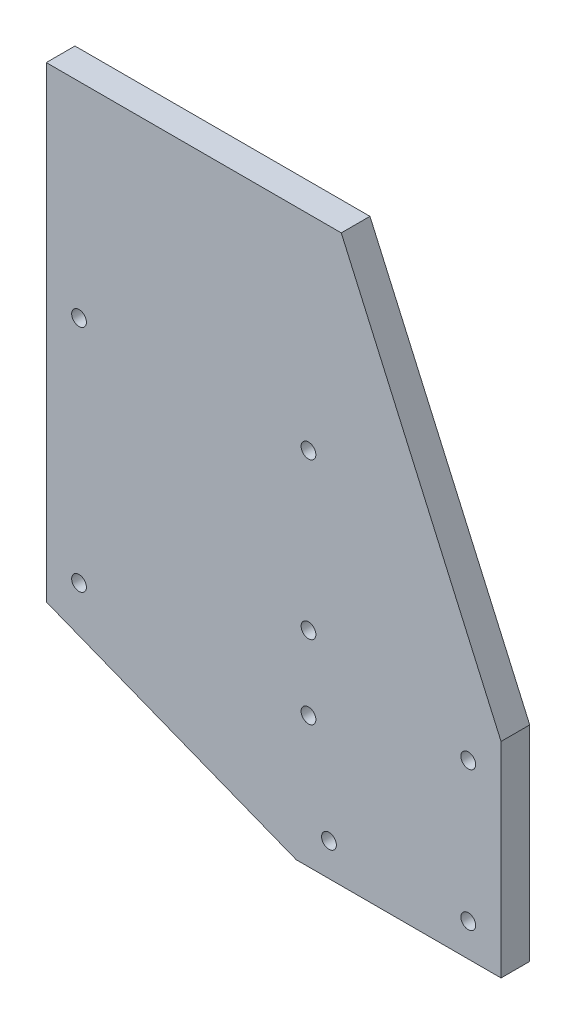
ISO-10303-21;
HEADER;
FILE_DESCRIPTION(('STEP AP214'),'2;1');
FILE_NAME('part.step','',(''),(''),'','','');
FILE_SCHEMA(('AUTOMOTIVE_DESIGN { 1 0 10303 214 1 1 1 1 }'));
ENDSEC;
DATA;
#1=APPLICATION_CONTEXT('core data for automotive mechanical design processes');
#2=APPLICATION_PROTOCOL_DEFINITION('international standard','automotive_design',2000,#1);
#3=PRODUCT_CONTEXT('',#1,'mechanical');
#4=PRODUCT('Part','Part','',(#3));
#5=PRODUCT_RELATED_PRODUCT_CATEGORY('part','',(#4));
#6=PRODUCT_DEFINITION_FORMATION('','',#4);
#7=PRODUCT_DEFINITION_CONTEXT('part definition',#1,'design');
#8=PRODUCT_DEFINITION('design','',#6,#7);
#9=PRODUCT_DEFINITION_SHAPE('','',#8);
#10=(LENGTH_UNIT() NAMED_UNIT(*) SI_UNIT(.MILLI.,.METRE.));
#11=(NAMED_UNIT(*) PLANE_ANGLE_UNIT() SI_UNIT($,.RADIAN.));
#12=(NAMED_UNIT(*) SI_UNIT($,.STERADIAN.) SOLID_ANGLE_UNIT());
#13=UNCERTAINTY_MEASURE_WITH_UNIT(LENGTH_MEASURE(1.E-05),#10,'distance_accuracy_value','');
#14=(GEOMETRIC_REPRESENTATION_CONTEXT(3) GLOBAL_UNCERTAINTY_ASSIGNED_CONTEXT((#13)) GLOBAL_UNIT_ASSIGNED_CONTEXT((#10,
#11,#12)) REPRESENTATION_CONTEXT('',''));
#15=CARTESIAN_POINT('',(0.,0.,0.));
#16=DIRECTION('',(0.,0.,1.));
#17=DIRECTION('',(1.,0.,0.));
#18=AXIS2_PLACEMENT_3D('',#15,#16,#17);
#19=CARTESIAN_POINT('',(79.583636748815,37.808676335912,35.));
#20=DIRECTION('',(0.,0.,1.));
#21=DIRECTION('',(1.,0.,0.));
#22=AXIS2_PLACEMENT_3D('',#19,#20,#21);
#23=PLANE('',#22);
#24=CARTESIAN_POINT('',(335.,-90.,35.));
#25=DIRECTION('',(0.,0.,1.));
#26=DIRECTION('',(1.,0.,0.));
#27=AXIS2_PLACEMENT_3D('',#24,#25,#26);
#28=CIRCLE('',#27,9.);
#29=CARTESIAN_POINT('',(344.,-90.,35.));
#30=VERTEX_POINT('',#29);
#31=EDGE_CURVE('E20',#30,#30,#28,.T.);
#32=ORIENTED_EDGE('',*,*,#31,.F.);
#33=EDGE_LOOP('',(#32));
#34=FACE_BOUND('',#33,.T.);
#35=CARTESIAN_POINT('',(335.,-260.,35.));
#36=DIRECTION('',(0.,0.,1.));
#37=DIRECTION('',(1.,0.,0.));
#38=AXIS2_PLACEMENT_3D('',#35,#36,#37);
#39=CIRCLE('',#38,9.);
#40=CARTESIAN_POINT('',(344.,-260.,35.));
#41=VERTEX_POINT('',#40);
#42=EDGE_CURVE('E293',#41,#41,#39,.T.);
#43=ORIENTED_EDGE('',*,*,#42,.F.);
#44=EDGE_LOOP('',(#43));
#45=FACE_BOUND('',#44,.T.);
#46=CARTESIAN_POINT('',(140.,-50.,35.));
#47=DIRECTION('',(0.,0.,1.));
#48=DIRECTION('',(1.,0.,0.));
#49=AXIS2_PLACEMENT_3D('',#46,#47,#48);
#50=CIRCLE('',#49,9.);
#51=CARTESIAN_POINT('',(149.,-50.,35.));
#52=VERTEX_POINT('',#51);
#53=EDGE_CURVE('E283',#52,#52,#50,.T.);
#54=ORIENTED_EDGE('',*,*,#53,.F.);
#55=EDGE_LOOP('',(#54));
#56=FACE_BOUND('',#55,.T.);
#57=CARTESIAN_POINT('',(165.,-260.,35.));
#58=DIRECTION('',(0.,0.,1.));
#59=DIRECTION('',(1.,0.,0.));
#60=AXIS2_PLACEMENT_3D('',#57,#58,#59);
#61=CIRCLE('',#60,9.);
#62=CARTESIAN_POINT('',(174.,-260.,35.));
#63=VERTEX_POINT('',#62);
#64=EDGE_CURVE('E273',#63,#63,#61,.T.);
#65=ORIENTED_EDGE('',*,*,#64,.F.);
#66=EDGE_LOOP('',(#65));
#67=FACE_BOUND('',#66,.T.);
#68=CARTESIAN_POINT('',(140.,140.,35.));
#69=DIRECTION('',(0.,0.,1.));
#70=DIRECTION('',(1.,0.,0.));
#71=AXIS2_PLACEMENT_3D('',#68,#69,#70);
#72=CIRCLE('',#71,9.);
#73=CARTESIAN_POINT('',(149.,140.,35.));
#74=VERTEX_POINT('',#73);
#75=EDGE_CURVE('E263',#74,#74,#72,.T.);
#76=ORIENTED_EDGE('',*,*,#75,.F.);
#77=EDGE_LOOP('',(#76));
#78=FACE_BOUND('',#77,.T.);
#79=CARTESIAN_POINT('',(140.,-140.,35.));
#80=DIRECTION('',(0.,0.,1.));
#81=DIRECTION('',(1.,0.,0.));
#82=AXIS2_PLACEMENT_3D('',#79,#80,#81);
#83=CIRCLE('',#82,9.);
#84=CARTESIAN_POINT('',(149.,-140.,35.));
#85=VERTEX_POINT('',#84);
#86=EDGE_CURVE('E253',#85,#85,#83,.T.);
#87=ORIENTED_EDGE('',*,*,#86,.F.);
#88=EDGE_LOOP('',(#87));
#89=FACE_BOUND('',#88,.T.);
#90=CARTESIAN_POINT('',(-140.,140.,35.));
#91=DIRECTION('',(0.,0.,1.));
#92=DIRECTION('',(1.,0.,0.));
#93=AXIS2_PLACEMENT_3D('',#90,#91,#92);
#94=CIRCLE('',#93,9.);
#95=CARTESIAN_POINT('',(-131.,140.,35.));
#96=VERTEX_POINT('',#95);
#97=EDGE_CURVE('E207',#96,#96,#94,.T.);
#98=ORIENTED_EDGE('',*,*,#97,.F.);
#99=EDGE_LOOP('',(#98));
#100=FACE_BOUND('',#99,.T.);
#101=CARTESIAN_POINT('',(-140.,-140.,35.));
#102=DIRECTION('',(0.,0.,1.));
#103=DIRECTION('',(1.,0.,0.));
#104=AXIS2_PLACEMENT_3D('',#101,#102,#103);
#105=CIRCLE('',#104,9.);
#106=CARTESIAN_POINT('',(-131.,-140.,35.));
#107=VERTEX_POINT('',#106);
#108=EDGE_CURVE('E234',#107,#107,#105,.T.);
#109=ORIENTED_EDGE('',*,*,#108,.F.);
#110=EDGE_LOOP('',(#109));
#111=FACE_BOUND('',#110,.T.);
#112=DIRECTION('',(0.930565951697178,-0.36612430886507,0.));
#113=VECTOR('',#112,1.);
#114=CARTESIAN_POINT('',(-180.,-180.,35.));
#115=LINE('',#114,#113);
#116=CARTESIAN_POINT('',(-180.,-180.,35.));
#117=VERTEX_POINT('',#116);
#118=CARTESIAN_POINT('',(125.,-300.,35.));
#119=VERTEX_POINT('',#118);
#120=EDGE_CURVE('E170',#117,#119,#115,.T.);
#121=ORIENTED_EDGE('',*,*,#120,.T.);
#122=DIRECTION('',(1.,0.,0.));
#123=VECTOR('',#122,1.);
#124=CARTESIAN_POINT('',(125.,-300.,35.));
#125=LINE('',#124,#123);
#126=CARTESIAN_POINT('',(375.,-300.,35.));
#127=VERTEX_POINT('',#126);
#128=EDGE_CURVE('E188',#119,#127,#125,.T.);
#129=ORIENTED_EDGE('',*,*,#128,.T.);
#130=DIRECTION('',(0.,1.,0.));
#131=VECTOR('',#130,1.);
#132=CARTESIAN_POINT('',(375.,-300.,35.));
#133=LINE('',#132,#131);
#134=CARTESIAN_POINT('',(375.,-50.,35.));
#135=VERTEX_POINT('',#134);
#136=EDGE_CURVE('E217',#127,#135,#133,.T.);
#137=ORIENTED_EDGE('',*,*,#136,.T.);
#138=DIRECTION('',(-0.4051743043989,0.914239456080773,0.));
#139=VECTOR('',#138,1.);
#140=CARTESIAN_POINT('',(375.,-50.,35.));
#141=LINE('',#140,#139);
#142=CARTESIAN_POINT('',(180.,390.,35.));
#143=VERTEX_POINT('',#142);
#144=EDGE_CURVE('E198',#135,#143,#141,.T.);
#145=ORIENTED_EDGE('',*,*,#144,.T.);
#146=DIRECTION('',(-1.,0.,0.));
#147=VECTOR('',#146,1.);
#148=CARTESIAN_POINT('',(180.,390.,35.));
#149=LINE('',#148,#147);
#150=CARTESIAN_POINT('',(-180.,390.,35.));
#151=VERTEX_POINT('',#150);
#152=EDGE_CURVE('E162',#143,#151,#149,.T.);
#153=ORIENTED_EDGE('',*,*,#152,.T.);
#154=DIRECTION('',(0.,-1.,0.));
#155=VECTOR('',#154,1.);
#156=CARTESIAN_POINT('',(-180.,390.,35.));
#157=LINE('',#156,#155);
#158=EDGE_CURVE('E161',#151,#117,#157,.T.);
#159=ORIENTED_EDGE('',*,*,#158,.T.);
#160=EDGE_LOOP('',(#121,#129,#137,#145,#153,#159));
#161=FACE_BOUND('',#160,.T.);
#162=ADVANCED_FACE('F16',(#34,#45,#56,#67,#78,#89,#100,#111,#161),#23,.T.);
#163=CARTESIAN_POINT('',(79.583636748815,37.808676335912,0.));
#164=DIRECTION('',(0.,0.,1.));
#165=DIRECTION('',(1.,0.,0.));
#166=AXIS2_PLACEMENT_3D('',#163,#164,#165);
#167=PLANE('',#166);
#168=CARTESIAN_POINT('',(335.,-90.,0.));
#169=DIRECTION('',(0.,0.,1.));
#170=DIRECTION('',(1.,0.,0.));
#171=AXIS2_PLACEMENT_3D('',#168,#169,#170);
#172=CIRCLE('',#171,9.);
#173=CARTESIAN_POINT('',(344.,-90.,0.));
#174=VERTEX_POINT('',#173);
#175=EDGE_CURVE('E10',#174,#174,#172,.T.);
#176=ORIENTED_EDGE('',*,*,#175,.T.);
#177=EDGE_LOOP('',(#176));
#178=FACE_BOUND('',#177,.T.);
#179=CARTESIAN_POINT('',(335.,-260.,0.));
#180=DIRECTION('',(0.,0.,1.));
#181=DIRECTION('',(1.,0.,0.));
#182=AXIS2_PLACEMENT_3D('',#179,#180,#181);
#183=CIRCLE('',#182,9.);
#184=CARTESIAN_POINT('',(344.,-260.,0.));
#185=VERTEX_POINT('',#184);
#186=EDGE_CURVE('E296',#185,#185,#183,.T.);
#187=ORIENTED_EDGE('',*,*,#186,.T.);
#188=EDGE_LOOP('',(#187));
#189=FACE_BOUND('',#188,.T.);
#190=CARTESIAN_POINT('',(140.,-50.,0.));
#191=DIRECTION('',(0.,0.,1.));
#192=DIRECTION('',(1.,0.,0.));
#193=AXIS2_PLACEMENT_3D('',#190,#191,#192);
#194=CIRCLE('',#193,9.);
#195=CARTESIAN_POINT('',(149.,-50.,0.));
#196=VERTEX_POINT('',#195);
#197=EDGE_CURVE('E286',#196,#196,#194,.T.);
#198=ORIENTED_EDGE('',*,*,#197,.T.);
#199=EDGE_LOOP('',(#198));
#200=FACE_BOUND('',#199,.T.);
#201=CARTESIAN_POINT('',(165.,-260.,0.));
#202=DIRECTION('',(0.,0.,1.));
#203=DIRECTION('',(1.,0.,0.));
#204=AXIS2_PLACEMENT_3D('',#201,#202,#203);
#205=CIRCLE('',#204,9.);
#206=CARTESIAN_POINT('',(174.,-260.,0.));
#207=VERTEX_POINT('',#206);
#208=EDGE_CURVE('E274',#207,#207,#205,.T.);
#209=ORIENTED_EDGE('',*,*,#208,.T.);
#210=EDGE_LOOP('',(#209));
#211=FACE_BOUND('',#210,.T.);
#212=CARTESIAN_POINT('',(140.,140.,0.));
#213=DIRECTION('',(0.,0.,1.));
#214=DIRECTION('',(1.,0.,0.));
#215=AXIS2_PLACEMENT_3D('',#212,#213,#214);
#216=CIRCLE('',#215,9.);
#217=CARTESIAN_POINT('',(149.,140.,0.));
#218=VERTEX_POINT('',#217);
#219=EDGE_CURVE('E266',#218,#218,#216,.T.);
#220=ORIENTED_EDGE('',*,*,#219,.T.);
#221=EDGE_LOOP('',(#220));
#222=FACE_BOUND('',#221,.T.);
#223=CARTESIAN_POINT('',(140.,-140.,0.));
#224=DIRECTION('',(0.,0.,1.));
#225=DIRECTION('',(1.,0.,0.));
#226=AXIS2_PLACEMENT_3D('',#223,#224,#225);
#227=CIRCLE('',#226,9.);
#228=CARTESIAN_POINT('',(149.,-140.,0.));
#229=VERTEX_POINT('',#228);
#230=EDGE_CURVE('E256',#229,#229,#227,.T.);
#231=ORIENTED_EDGE('',*,*,#230,.T.);
#232=EDGE_LOOP('',(#231));
#233=FACE_BOUND('',#232,.T.);
#234=CARTESIAN_POINT('',(-140.,140.,0.));
#235=DIRECTION('',(0.,0.,1.));
#236=DIRECTION('',(1.,0.,0.));
#237=AXIS2_PLACEMENT_3D('',#234,#235,#236);
#238=CIRCLE('',#237,9.);
#239=CARTESIAN_POINT('',(-131.,140.,0.));
#240=VERTEX_POINT('',#239);
#241=EDGE_CURVE('E203',#240,#240,#238,.T.);
#242=ORIENTED_EDGE('',*,*,#241,.T.);
#243=EDGE_LOOP('',(#242));
#244=FACE_BOUND('',#243,.T.);
#245=CARTESIAN_POINT('',(-140.,-140.,0.));
#246=DIRECTION('',(0.,0.,1.));
#247=DIRECTION('',(1.,0.,0.));
#248=AXIS2_PLACEMENT_3D('',#245,#246,#247);
#249=CIRCLE('',#248,9.);
#250=CARTESIAN_POINT('',(-131.,-140.,0.));
#251=VERTEX_POINT('',#250);
#252=EDGE_CURVE('E230',#251,#251,#249,.T.);
#253=ORIENTED_EDGE('',*,*,#252,.T.);
#254=EDGE_LOOP('',(#253));
#255=FACE_BOUND('',#254,.T.);
#256=DIRECTION('',(0.,-1.,0.));
#257=VECTOR('',#256,1.);
#258=CARTESIAN_POINT('',(-180.,390.,0.));
#259=LINE('',#258,#257);
#260=CARTESIAN_POINT('',(-180.,390.,0.));
#261=VERTEX_POINT('',#260);
#262=CARTESIAN_POINT('',(-180.,-180.,0.));
#263=VERTEX_POINT('',#262);
#264=EDGE_CURVE('E150',#261,#263,#259,.T.);
#265=ORIENTED_EDGE('',*,*,#264,.F.);
#266=DIRECTION('',(-1.,0.,0.));
#267=VECTOR('',#266,1.);
#268=CARTESIAN_POINT('',(180.,390.,0.));
#269=LINE('',#268,#267);
#270=CARTESIAN_POINT('',(180.,390.,0.));
#271=VERTEX_POINT('',#270);
#272=EDGE_CURVE('E227',#271,#261,#269,.T.);
#273=ORIENTED_EDGE('',*,*,#272,.F.);
#274=DIRECTION('',(-0.4051743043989,0.914239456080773,0.));
#275=VECTOR('',#274,1.);
#276=CARTESIAN_POINT('',(375.,-50.,0.));
#277=LINE('',#276,#275);
#278=CARTESIAN_POINT('',(375.,-50.,0.));
#279=VERTEX_POINT('',#278);
#280=EDGE_CURVE('E199',#279,#271,#277,.T.);
#281=ORIENTED_EDGE('',*,*,#280,.F.);
#282=DIRECTION('',(0.,1.,0.));
#283=VECTOR('',#282,1.);
#284=CARTESIAN_POINT('',(375.,-300.,0.));
#285=LINE('',#284,#283);
#286=CARTESIAN_POINT('',(375.,-300.,0.));
#287=VERTEX_POINT('',#286);
#288=EDGE_CURVE('E183',#287,#279,#285,.T.);
#289=ORIENTED_EDGE('',*,*,#288,.F.);
#290=DIRECTION('',(1.,0.,0.));
#291=VECTOR('',#290,1.);
#292=CARTESIAN_POINT('',(125.,-300.,0.));
#293=LINE('',#292,#291);
#294=CARTESIAN_POINT('',(125.,-300.,0.));
#295=VERTEX_POINT('',#294);
#296=EDGE_CURVE('E172',#295,#287,#293,.T.);
#297=ORIENTED_EDGE('',*,*,#296,.F.);
#298=DIRECTION('',(0.930565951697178,-0.36612430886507,0.));
#299=VECTOR('',#298,1.);
#300=CARTESIAN_POINT('',(-180.,-180.,0.));
#301=LINE('',#300,#299);
#302=EDGE_CURVE('E168',#263,#295,#301,.T.);
#303=ORIENTED_EDGE('',*,*,#302,.F.);
#304=EDGE_LOOP('',(#265,#273,#281,#289,#297,#303));
#305=FACE_BOUND('',#304,.T.);
#306=ADVANCED_FACE('F18',(#178,#189,#200,#211,#222,#233,#244,#255,#305),#167,.F.);
#307=CARTESIAN_POINT('',(335.,-90.,0.));
#308=DIRECTION('',(0.,0.,-1.));
#309=DIRECTION('',(1.,0.,0.));
#310=AXIS2_PLACEMENT_3D('',#307,#308,#309);
#311=CYLINDRICAL_SURFACE('',#310,9.);
#312=DIRECTION('',(0.,0.,1.));
#313=VECTOR('',#312,1.);
#314=CARTESIAN_POINT('',(344.,-90.,0.));
#315=LINE('',#314,#313);
#316=EDGE_CURVE('E298',#174,#30,#315,.T.);
#317=ORIENTED_EDGE('',*,*,#316,.T.);
#318=ORIENTED_EDGE('',*,*,#31,.T.);
#319=ORIENTED_EDGE('',*,*,#316,.F.);
#320=ORIENTED_EDGE('',*,*,#175,.F.);
#321=EDGE_LOOP('',(#317,#318,#319,#320));
#322=FACE_BOUND('',#321,.T.);
#323=ADVANCED_FACE('F425',(#322),#311,.F.);
#324=CARTESIAN_POINT('',(335.,-260.,0.));
#325=DIRECTION('',(0.,0.,-1.));
#326=DIRECTION('',(1.,0.,0.));
#327=AXIS2_PLACEMENT_3D('',#324,#325,#326);
#328=CYLINDRICAL_SURFACE('',#327,9.);
#329=DIRECTION('',(0.,0.,1.));
#330=VECTOR('',#329,1.);
#331=CARTESIAN_POINT('',(344.,-260.,0.));
#332=LINE('',#331,#330);
#333=EDGE_CURVE('E289',#185,#41,#332,.T.);
#334=ORIENTED_EDGE('',*,*,#333,.T.);
#335=ORIENTED_EDGE('',*,*,#42,.T.);
#336=ORIENTED_EDGE('',*,*,#333,.F.);
#337=ORIENTED_EDGE('',*,*,#186,.F.);
#338=EDGE_LOOP('',(#334,#335,#336,#337));
#339=FACE_BOUND('',#338,.T.);
#340=ADVANCED_FACE('F376',(#339),#328,.F.);
#341=CARTESIAN_POINT('',(140.,-50.,0.));
#342=DIRECTION('',(0.,0.,-1.));
#343=DIRECTION('',(1.,0.,0.));
#344=AXIS2_PLACEMENT_3D('',#341,#342,#343);
#345=CYLINDRICAL_SURFACE('',#344,9.);
#346=DIRECTION('',(0.,0.,1.));
#347=VECTOR('',#346,1.);
#348=CARTESIAN_POINT('',(149.,-50.,0.));
#349=LINE('',#348,#347);
#350=EDGE_CURVE('E277',#196,#52,#349,.T.);
#351=ORIENTED_EDGE('',*,*,#350,.T.);
#352=ORIENTED_EDGE('',*,*,#53,.T.);
#353=ORIENTED_EDGE('',*,*,#350,.F.);
#354=ORIENTED_EDGE('',*,*,#197,.F.);
#355=EDGE_LOOP('',(#351,#352,#353,#354));
#356=FACE_BOUND('',#355,.T.);
#357=ADVANCED_FACE('F370',(#356),#345,.F.);
#358=CARTESIAN_POINT('',(165.,-260.,0.));
#359=DIRECTION('',(0.,0.,-1.));
#360=DIRECTION('',(1.,0.,0.));
#361=AXIS2_PLACEMENT_3D('',#358,#359,#360);
#362=CYLINDRICAL_SURFACE('',#361,9.);
#363=DIRECTION('',(0.,0.,1.));
#364=VECTOR('',#363,1.);
#365=CARTESIAN_POINT('',(174.,-260.,0.));
#366=LINE('',#365,#364);
#367=EDGE_CURVE('E269',#207,#63,#366,.T.);
#368=ORIENTED_EDGE('',*,*,#367,.T.);
#369=ORIENTED_EDGE('',*,*,#64,.T.);
#370=ORIENTED_EDGE('',*,*,#367,.F.);
#371=ORIENTED_EDGE('',*,*,#208,.F.);
#372=EDGE_LOOP('',(#368,#369,#370,#371));
#373=FACE_BOUND('',#372,.T.);
#374=ADVANCED_FACE('F375',(#373),#362,.F.);
#375=CARTESIAN_POINT('',(140.,140.,0.));
#376=DIRECTION('',(0.,0.,-1.));
#377=DIRECTION('',(1.,0.,0.));
#378=AXIS2_PLACEMENT_3D('',#375,#376,#377);
#379=CYLINDRICAL_SURFACE('',#378,9.);
#380=DIRECTION('',(0.,0.,1.));
#381=VECTOR('',#380,1.);
#382=CARTESIAN_POINT('',(149.,140.,0.));
#383=LINE('',#382,#381);
#384=EDGE_CURVE('E259',#218,#74,#383,.T.);
#385=ORIENTED_EDGE('',*,*,#384,.T.);
#386=ORIENTED_EDGE('',*,*,#75,.T.);
#387=ORIENTED_EDGE('',*,*,#384,.F.);
#388=ORIENTED_EDGE('',*,*,#219,.F.);
#389=EDGE_LOOP('',(#385,#386,#387,#388));
#390=FACE_BOUND('',#389,.T.);
#391=ADVANCED_FACE('F393',(#390),#379,.F.);
#392=CARTESIAN_POINT('',(140.,-140.,0.));
#393=DIRECTION('',(0.,0.,-1.));
#394=DIRECTION('',(1.,0.,0.));
#395=AXIS2_PLACEMENT_3D('',#392,#393,#394);
#396=CYLINDRICAL_SURFACE('',#395,9.);
#397=DIRECTION('',(0.,0.,1.));
#398=VECTOR('',#397,1.);
#399=CARTESIAN_POINT('',(149.,-140.,0.));
#400=LINE('',#399,#398);
#401=EDGE_CURVE('E206',#229,#85,#400,.T.);
#402=ORIENTED_EDGE('',*,*,#401,.T.);
#403=ORIENTED_EDGE('',*,*,#86,.T.);
#404=ORIENTED_EDGE('',*,*,#401,.F.);
#405=ORIENTED_EDGE('',*,*,#230,.F.);
#406=EDGE_LOOP('',(#402,#403,#404,#405));
#407=FACE_BOUND('',#406,.T.);
#408=ADVANCED_FACE('F312',(#407),#396,.F.);
#409=CARTESIAN_POINT('',(-140.,140.,0.));
#410=DIRECTION('',(0.,0.,-1.));
#411=DIRECTION('',(1.,0.,0.));
#412=AXIS2_PLACEMENT_3D('',#409,#410,#411);
#413=CYLINDRICAL_SURFACE('',#412,9.);
#414=DIRECTION('',(0.,0.,1.));
#415=VECTOR('',#414,1.);
#416=CARTESIAN_POINT('',(-131.,140.,0.));
#417=LINE('',#416,#415);
#418=EDGE_CURVE('E233',#240,#96,#417,.T.);
#419=ORIENTED_EDGE('',*,*,#418,.T.);
#420=ORIENTED_EDGE('',*,*,#97,.T.);
#421=ORIENTED_EDGE('',*,*,#418,.F.);
#422=ORIENTED_EDGE('',*,*,#241,.F.);
#423=EDGE_LOOP('',(#419,#420,#421,#422));
#424=FACE_BOUND('',#423,.T.);
#425=ADVANCED_FACE('F306',(#424),#413,.F.);
#426=CARTESIAN_POINT('',(-140.,-140.,0.));
#427=DIRECTION('',(0.,0.,-1.));
#428=DIRECTION('',(1.,0.,0.));
#429=AXIS2_PLACEMENT_3D('',#426,#427,#428);
#430=CYLINDRICAL_SURFACE('',#429,9.);
#431=DIRECTION('',(0.,0.,1.));
#432=VECTOR('',#431,1.);
#433=CARTESIAN_POINT('',(-131.,-140.,0.));
#434=LINE('',#433,#432);
#435=EDGE_CURVE('E239',#251,#107,#434,.T.);
#436=ORIENTED_EDGE('',*,*,#435,.T.);
#437=ORIENTED_EDGE('',*,*,#108,.T.);
#438=ORIENTED_EDGE('',*,*,#435,.F.);
#439=ORIENTED_EDGE('',*,*,#252,.F.);
#440=EDGE_LOOP('',(#436,#437,#438,#439));
#441=FACE_BOUND('',#440,.T.);
#442=ADVANCED_FACE('F311',(#441),#430,.F.);
#443=CARTESIAN_POINT('',(-180.,390.,0.));
#444=DIRECTION('',(1.,0.,0.));
#445=DIRECTION('',(0.,1.,0.));
#446=AXIS2_PLACEMENT_3D('',#443,#444,#445);
#447=PLANE('',#446);
#448=ORIENTED_EDGE('',*,*,#264,.T.);
#449=DIRECTION('',(0.,0.,1.));
#450=VECTOR('',#449,1.);
#451=CARTESIAN_POINT('',(-180.,-180.,0.));
#452=LINE('',#451,#450);
#453=EDGE_CURVE('E153',#263,#117,#452,.T.);
#454=ORIENTED_EDGE('',*,*,#453,.T.);
#455=ORIENTED_EDGE('',*,*,#158,.F.);
#456=DIRECTION('',(0.,0.,1.));
#457=VECTOR('',#456,1.);
#458=CARTESIAN_POINT('',(-180.,390.,0.));
#459=LINE('',#458,#457);
#460=EDGE_CURVE('E156',#261,#151,#459,.T.);
#461=ORIENTED_EDGE('',*,*,#460,.F.);
#462=EDGE_LOOP('',(#448,#454,#455,#461));
#463=FACE_BOUND('',#462,.T.);
#464=ADVANCED_FACE('F152',(#463),#447,.F.);
#465=CARTESIAN_POINT('',(180.,390.,0.));
#466=DIRECTION('',(0.,-1.,0.));
#467=DIRECTION('',(0.,0.,-1.));
#468=AXIS2_PLACEMENT_3D('',#465,#466,#467);
#469=PLANE('',#468);
#470=ORIENTED_EDGE('',*,*,#272,.T.);
#471=ORIENTED_EDGE('',*,*,#460,.T.);
#472=ORIENTED_EDGE('',*,*,#152,.F.);
#473=DIRECTION('',(0.,0.,1.));
#474=VECTOR('',#473,1.);
#475=CARTESIAN_POINT('',(180.,390.,0.));
#476=LINE('',#475,#474);
#477=EDGE_CURVE('E194',#271,#143,#476,.T.);
#478=ORIENTED_EDGE('',*,*,#477,.F.);
#479=EDGE_LOOP('',(#470,#471,#472,#478));
#480=FACE_BOUND('',#479,.T.);
#481=ADVANCED_FACE('F358',(#480),#469,.F.);
#482=CARTESIAN_POINT('',(375.,-50.,0.));
#483=DIRECTION('',(-0.914239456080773,-0.4051743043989,0.));
#484=DIRECTION('',(-0.4051743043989,0.914239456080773,0.));
#485=AXIS2_PLACEMENT_3D('',#482,#483,#484);
#486=PLANE('',#485);
#487=ORIENTED_EDGE('',*,*,#280,.T.);
#488=ORIENTED_EDGE('',*,*,#477,.T.);
#489=ORIENTED_EDGE('',*,*,#144,.F.);
#490=DIRECTION('',(0.,0.,1.));
#491=VECTOR('',#490,1.);
#492=CARTESIAN_POINT('',(375.,-50.,0.));
#493=LINE('',#492,#491);
#494=EDGE_CURVE('E187',#279,#135,#493,.T.);
#495=ORIENTED_EDGE('',*,*,#494,.F.);
#496=EDGE_LOOP('',(#487,#488,#489,#495));
#497=FACE_BOUND('',#496,.T.);
#498=ADVANCED_FACE('F341',(#497),#486,.F.);
#499=CARTESIAN_POINT('',(375.,-300.,0.));
#500=DIRECTION('',(-1.,0.,0.));
#501=DIRECTION('',(0.,0.,1.));
#502=AXIS2_PLACEMENT_3D('',#499,#500,#501);
#503=PLANE('',#502);
#504=ORIENTED_EDGE('',*,*,#288,.T.);
#505=ORIENTED_EDGE('',*,*,#494,.T.);
#506=ORIENTED_EDGE('',*,*,#136,.F.);
#507=DIRECTION('',(0.,0.,1.));
#508=VECTOR('',#507,1.);
#509=CARTESIAN_POINT('',(375.,-300.,0.));
#510=LINE('',#509,#508);
#511=EDGE_CURVE('E193',#287,#127,#510,.T.);
#512=ORIENTED_EDGE('',*,*,#511,.F.);
#513=EDGE_LOOP('',(#504,#505,#506,#512));
#514=FACE_BOUND('',#513,.T.);
#515=ADVANCED_FACE('F332',(#514),#503,.F.);
#516=CARTESIAN_POINT('',(125.,-300.,0.));
#517=DIRECTION('',(0.,1.,0.));
#518=DIRECTION('',(1.,0.,0.));
#519=AXIS2_PLACEMENT_3D('',#516,#517,#518);
#520=PLANE('',#519);
#521=ORIENTED_EDGE('',*,*,#296,.T.);
#522=ORIENTED_EDGE('',*,*,#511,.T.);
#523=ORIENTED_EDGE('',*,*,#128,.F.);
#524=DIRECTION('',(0.,0.,1.));
#525=VECTOR('',#524,1.);
#526=CARTESIAN_POINT('',(125.,-300.,0.));
#527=LINE('',#526,#525);
#528=EDGE_CURVE('E177',#295,#119,#527,.T.);
#529=ORIENTED_EDGE('',*,*,#528,.F.);
#530=EDGE_LOOP('',(#521,#522,#523,#529));
#531=FACE_BOUND('',#530,.T.);
#532=ADVANCED_FACE('F324',(#531),#520,.F.);
#533=CARTESIAN_POINT('',(-180.,-180.,0.));
#534=DIRECTION('',(0.36612430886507,0.930565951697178,0.));
#535=DIRECTION('',(0.,0.,-1.));
#536=AXIS2_PLACEMENT_3D('',#533,#534,#535);
#537=PLANE('',#536);
#538=ORIENTED_EDGE('',*,*,#302,.T.);
#539=ORIENTED_EDGE('',*,*,#528,.T.);
#540=ORIENTED_EDGE('',*,*,#120,.F.);
#541=ORIENTED_EDGE('',*,*,#453,.F.);
#542=EDGE_LOOP('',(#538,#539,#540,#541));
#543=FACE_BOUND('',#542,.T.);
#544=ADVANCED_FACE('F166',(#543),#537,.F.);
#545=CLOSED_SHELL('',(#162,#306,#323,#340,#357,#374,#391,#408,#425,#442,#464,#481,#498,#515,
#532,#544));
#546=MANIFOLD_SOLID_BREP('B1',#545);
#547=ADVANCED_BREP_SHAPE_REPRESENTATION('',(#18,#546),#14);
#548=SHAPE_DEFINITION_REPRESENTATION(#9,#547);
ENDSEC;
END-ISO-10303-21;
